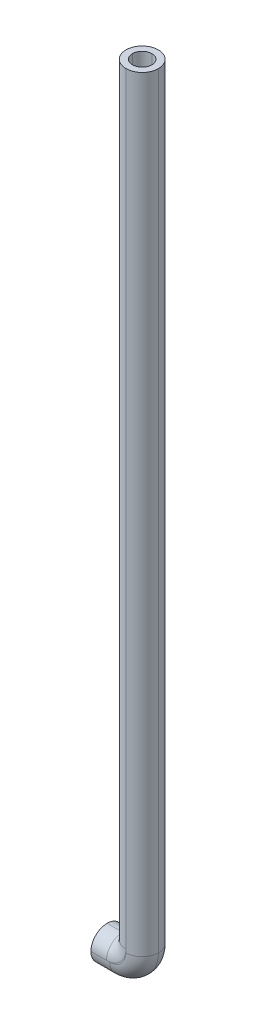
ISO-10303-21;
HEADER;
FILE_DESCRIPTION(('STEP AP214'),'2;1');
FILE_NAME('part.step','',(''),(''),'','','');
FILE_SCHEMA(('AUTOMOTIVE_DESIGN { 1 0 10303 214 1 1 1 1 }'));
ENDSEC;
DATA;
#1=APPLICATION_CONTEXT('core data for automotive mechanical design processes');
#2=APPLICATION_PROTOCOL_DEFINITION('international standard','automotive_design',2000,#1);
#3=PRODUCT_CONTEXT('',#1,'mechanical');
#4=PRODUCT('Part','Part','',(#3));
#5=PRODUCT_RELATED_PRODUCT_CATEGORY('part','',(#4));
#6=PRODUCT_DEFINITION_FORMATION('','',#4);
#7=PRODUCT_DEFINITION_CONTEXT('part definition',#1,'design');
#8=PRODUCT_DEFINITION('design','',#6,#7);
#9=PRODUCT_DEFINITION_SHAPE('','',#8);
#10=(LENGTH_UNIT() NAMED_UNIT(*) SI_UNIT(.MILLI.,.METRE.));
#11=(NAMED_UNIT(*) PLANE_ANGLE_UNIT() SI_UNIT($,.RADIAN.));
#12=(NAMED_UNIT(*) SI_UNIT($,.STERADIAN.) SOLID_ANGLE_UNIT());
#13=UNCERTAINTY_MEASURE_WITH_UNIT(LENGTH_MEASURE(1.E-05),#10,'distance_accuracy_value','');
#14=(GEOMETRIC_REPRESENTATION_CONTEXT(3) GLOBAL_UNCERTAINTY_ASSIGNED_CONTEXT((#13)) GLOBAL_UNIT_ASSIGNED_CONTEXT((#10,
#11,#12)) REPRESENTATION_CONTEXT('',''));
#15=CARTESIAN_POINT('',(0.,0.,0.));
#16=DIRECTION('',(0.,0.,1.));
#17=DIRECTION('',(1.,0.,0.));
#18=AXIS2_PLACEMENT_3D('',#15,#16,#17);
#19=CARTESIAN_POINT('',(-310.599028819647,-49.728751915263,25.4));
#20=DIRECTION('',(0.,-1.,0.));
#21=DIRECTION('',(1.,0.,0.));
#22=AXIS2_PLACEMENT_3D('',#19,#20,#21);
#23=PLANE('',#22);
#24=CARTESIAN_POINT('',(-323.299028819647,-49.728751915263,12.7));
#25=DIRECTION('',(0.,-1.,0.));
#26=DIRECTION('',(1.,0.,0.));
#27=AXIS2_PLACEMENT_3D('',#24,#25,#26);
#28=CIRCLE('',#27,7.62);
#29=CARTESIAN_POINT('',(-323.299028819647,-49.7287519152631,20.32));
#30=VERTEX_POINT('',#29);
#31=CARTESIAN_POINT('',(-330.919028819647,-49.7287519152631,12.7));
#32=VERTEX_POINT('',#31);
#33=EDGE_CURVE('E629',#30,#32,#28,.T.);
#34=ORIENTED_EDGE('',*,*,#33,.T.);
#35=CARTESIAN_POINT('',(-323.299028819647,-49.728751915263,12.7));
#36=DIRECTION('',(0.,-1.,0.));
#37=DIRECTION('',(1.,0.,0.));
#38=AXIS2_PLACEMENT_3D('',#35,#36,#37);
#39=CIRCLE('',#38,7.62);
#40=CARTESIAN_POINT('',(-323.299028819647,-49.7287519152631,5.08));
#41=VERTEX_POINT('',#40);
#42=EDGE_CURVE('E229',#32,#41,#39,.T.);
#43=ORIENTED_EDGE('',*,*,#42,.T.);
#44=CARTESIAN_POINT('',(-323.299028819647,-49.728751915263,12.7));
#45=DIRECTION('',(0.,-1.,0.));
#46=DIRECTION('',(1.,0.,0.));
#47=AXIS2_PLACEMENT_3D('',#44,#45,#46);
#48=CIRCLE('',#47,7.62);
#49=CARTESIAN_POINT('',(-315.679028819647,-49.728751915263,12.7));
#50=VERTEX_POINT('',#49);
#51=EDGE_CURVE('E631',#41,#50,#48,.T.);
#52=ORIENTED_EDGE('',*,*,#51,.T.);
#53=CARTESIAN_POINT('',(-323.299028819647,-49.728751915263,12.7));
#54=DIRECTION('',(0.,-1.,0.));
#55=DIRECTION('',(1.,0.,0.));
#56=AXIS2_PLACEMENT_3D('',#53,#54,#55);
#57=CIRCLE('',#56,7.62);
#58=EDGE_CURVE('E626',#50,#30,#57,.T.);
#59=ORIENTED_EDGE('',*,*,#58,.T.);
#60=EDGE_LOOP('',(#34,#43,#52,#59));
#61=FACE_BOUND('',#60,.T.);
#62=CARTESIAN_POINT('',(-323.299028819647,-49.728751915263,12.7));
#63=DIRECTION('',(0.,-1.,0.));
#64=DIRECTION('',(1.,0.,0.));
#65=AXIS2_PLACEMENT_3D('',#62,#63,#64);
#66=CIRCLE('',#65,12.7);
#67=CARTESIAN_POINT('',(-310.599028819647,-49.728751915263,12.7));
#68=VERTEX_POINT('',#67);
#69=CARTESIAN_POINT('',(-323.299028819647,-49.728751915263,0.));
#70=VERTEX_POINT('',#69);
#71=EDGE_CURVE('E175',#68,#70,#66,.F.);
#72=ORIENTED_EDGE('',*,*,#71,.T.);
#73=CARTESIAN_POINT('',(-323.299028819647,-49.7287519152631,12.7));
#74=DIRECTION('',(0.,-1.,0.));
#75=DIRECTION('',(1.,0.,0.));
#76=AXIS2_PLACEMENT_3D('',#73,#74,#75);
#77=CIRCLE('',#76,12.7);
#78=CARTESIAN_POINT('',(-335.999028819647,-49.7287519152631,12.7));
#79=VERTEX_POINT('',#78);
#80=EDGE_CURVE('E11',#70,#79,#77,.F.);
#81=ORIENTED_EDGE('',*,*,#80,.T.);
#82=CARTESIAN_POINT('',(-323.299028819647,-49.728751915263,12.7));
#83=DIRECTION('',(0.,-1.,0.));
#84=DIRECTION('',(1.,0.,0.));
#85=AXIS2_PLACEMENT_3D('',#82,#83,#84);
#86=CIRCLE('',#85,12.7);
#87=CARTESIAN_POINT('',(-323.299028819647,-49.728751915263,25.4));
#88=VERTEX_POINT('',#87);
#89=EDGE_CURVE('E42',#79,#88,#86,.F.);
#90=ORIENTED_EDGE('',*,*,#89,.T.);
#91=CARTESIAN_POINT('',(-323.299028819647,-49.728751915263,12.7));
#92=DIRECTION('',(0.,-1.,0.));
#93=DIRECTION('',(1.,0.,0.));
#94=AXIS2_PLACEMENT_3D('',#91,#92,#93);
#95=CIRCLE('',#94,12.7);
#96=EDGE_CURVE('E51',#88,#68,#95,.F.);
#97=ORIENTED_EDGE('',*,*,#96,.T.);
#98=EDGE_LOOP('',(#72,#81,#90,#97));
#99=FACE_BOUND('',#98,.T.);
#100=ADVANCED_FACE('F32',(#61,#99),#23,.F.);
#101=CARTESIAN_POINT('',(-350.731028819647,-649.228751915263,25.4));
#102=DIRECTION('',(1.,0.,0.));
#103=DIRECTION('',(0.,0.,-1.));
#104=AXIS2_PLACEMENT_3D('',#101,#102,#103);
#105=PLANE('',#104);
#106=CARTESIAN_POINT('',(-350.731028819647,-661.928751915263,12.7));
#107=DIRECTION('',(1.,0.,0.));
#108=DIRECTION('',(0.,0.,-1.));
#109=AXIS2_PLACEMENT_3D('',#106,#107,#108);
#110=CIRCLE('',#109,7.62);
#111=CARTESIAN_POINT('',(-350.731028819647,-669.548751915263,12.7));
#112=VERTEX_POINT('',#111);
#113=CARTESIAN_POINT('',(-350.731028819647,-661.928751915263,5.08));
#114=VERTEX_POINT('',#113);
#115=EDGE_CURVE('E623',#112,#114,#110,.T.);
#116=ORIENTED_EDGE('',*,*,#115,.T.);
#117=CARTESIAN_POINT('',(-350.731028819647,-661.928751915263,12.7));
#118=DIRECTION('',(1.,0.,0.));
#119=DIRECTION('',(0.,0.,-1.));
#120=AXIS2_PLACEMENT_3D('',#117,#118,#119);
#121=CIRCLE('',#120,7.62);
#122=CARTESIAN_POINT('',(-350.731028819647,-654.308751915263,12.7));
#123=VERTEX_POINT('',#122);
#124=EDGE_CURVE('E611',#114,#123,#121,.T.);
#125=ORIENTED_EDGE('',*,*,#124,.T.);
#126=CARTESIAN_POINT('',(-350.731028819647,-661.928751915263,12.7));
#127=DIRECTION('',(1.,0.,0.));
#128=DIRECTION('',(0.,0.,-1.));
#129=AXIS2_PLACEMENT_3D('',#126,#127,#128);
#130=CIRCLE('',#129,7.62);
#131=CARTESIAN_POINT('',(-350.731028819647,-661.928751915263,20.32));
#132=VERTEX_POINT('',#131);
#133=EDGE_CURVE('E617',#123,#132,#130,.T.);
#134=ORIENTED_EDGE('',*,*,#133,.T.);
#135=CARTESIAN_POINT('',(-350.731028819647,-661.928751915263,12.7));
#136=DIRECTION('',(1.,0.,0.));
#137=DIRECTION('',(0.,0.,-1.));
#138=AXIS2_PLACEMENT_3D('',#135,#136,#137);
#139=CIRCLE('',#138,7.62);
#140=EDGE_CURVE('E614',#132,#112,#139,.T.);
#141=ORIENTED_EDGE('',*,*,#140,.T.);
#142=EDGE_LOOP('',(#116,#125,#134,#141));
#143=FACE_BOUND('',#142,.T.);
#144=CARTESIAN_POINT('',(-350.731028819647,-661.928751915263,12.7));
#145=DIRECTION('',(1.,0.,0.));
#146=DIRECTION('',(0.,0.,-1.));
#147=AXIS2_PLACEMENT_3D('',#144,#145,#146);
#148=CIRCLE('',#147,12.7);
#149=CARTESIAN_POINT('',(-350.731028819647,-661.928751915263,25.4));
#150=VERTEX_POINT('',#149);
#151=CARTESIAN_POINT('',(-350.731028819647,-649.228751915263,12.7));
#152=VERTEX_POINT('',#151);
#153=EDGE_CURVE('E146',#150,#152,#148,.F.);
#154=ORIENTED_EDGE('',*,*,#153,.T.);
#155=CARTESIAN_POINT('',(-350.731028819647,-661.928751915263,12.7));
#156=DIRECTION('',(1.,0.,0.));
#157=DIRECTION('',(0.,0.,-1.));
#158=AXIS2_PLACEMENT_3D('',#155,#156,#157);
#159=CIRCLE('',#158,12.7);
#160=CARTESIAN_POINT('',(-350.731028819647,-661.928751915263,0.));
#161=VERTEX_POINT('',#160);
#162=EDGE_CURVE('E281',#152,#161,#159,.F.);
#163=ORIENTED_EDGE('',*,*,#162,.T.);
#164=CARTESIAN_POINT('',(-350.731028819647,-661.928751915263,12.7));
#165=DIRECTION('',(1.,0.,0.));
#166=DIRECTION('',(0.,0.,-1.));
#167=AXIS2_PLACEMENT_3D('',#164,#165,#166);
#168=CIRCLE('',#167,12.7);
#169=CARTESIAN_POINT('',(-350.731028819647,-674.628751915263,12.7));
#170=VERTEX_POINT('',#169);
#171=EDGE_CURVE('E278',#161,#170,#168,.F.);
#172=ORIENTED_EDGE('',*,*,#171,.T.);
#173=CARTESIAN_POINT('',(-350.731028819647,-661.928751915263,12.7));
#174=DIRECTION('',(1.,0.,0.));
#175=DIRECTION('',(0.,0.,-1.));
#176=AXIS2_PLACEMENT_3D('',#173,#174,#175);
#177=CIRCLE('',#176,12.7);
#178=EDGE_CURVE('E276',#170,#150,#177,.F.);
#179=ORIENTED_EDGE('',*,*,#178,.T.);
#180=EDGE_LOOP('',(#154,#163,#172,#179));
#181=FACE_BOUND('',#180,.T.);
#182=ADVANCED_FACE('F317',(#143,#181),#105,.F.);
#183=CARTESIAN_POINT('',(-335.999028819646,-649.228751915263,25.4));
#184=DIRECTION('',(0.,0.,1.));
#185=DIRECTION('',(1.,0.,0.));
#186=AXIS2_PLACEMENT_3D('',#183,#184,#185);
#187=PLANE('',#186);
#188=DIRECTION('',(0.,1.,0.));
#189=VECTOR('',#188,1.);
#190=CARTESIAN_POINT('',(-323.299028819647,-49.728751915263,25.4));
#191=LINE('',#190,#189);
#192=CARTESIAN_POINT('',(-323.299028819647,-649.228751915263,25.4));
#193=VERTEX_POINT('',#192);
#194=CARTESIAN_POINT('',(-323.299028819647,-646.688751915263,25.4));
#195=VERTEX_POINT('',#194);
#196=EDGE_CURVE('E172',#193,#195,#191,.T.);
#197=ORIENTED_EDGE('',*,*,#196,.T.);
#198=CARTESIAN_POINT('',(-338.539028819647,-646.688751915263,25.4));
#199=DIRECTION('',(0.,0.,1.));
#200=DIRECTION('',(1.,0.,0.));
#201=AXIS2_PLACEMENT_3D('',#198,#199,#200);
#202=CIRCLE('',#201,15.24);
#203=CARTESIAN_POINT('',(-338.539028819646,-661.928751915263,25.4));
#204=VERTEX_POINT('',#203);
#205=EDGE_CURVE('E157',#195,#204,#202,.F.);
#206=ORIENTED_EDGE('',*,*,#205,.T.);
#207=DIRECTION('',(1.,0.,0.));
#208=VECTOR('',#207,1.);
#209=CARTESIAN_POINT('',(-335.999028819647,-661.928751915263,25.4));
#210=LINE('',#209,#208);
#211=CARTESIAN_POINT('',(-335.999028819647,-661.928751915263,25.4));
#212=VERTEX_POINT('',#211);
#213=EDGE_CURVE('E162',#204,#212,#210,.T.);
#214=ORIENTED_EDGE('',*,*,#213,.T.);
#215=CARTESIAN_POINT('',(-335.999028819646,-649.228751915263,25.4));
#216=DIRECTION('',(0.,0.,1.));
#217=DIRECTION('',(1.,0.,0.));
#218=AXIS2_PLACEMENT_3D('',#215,#216,#217);
#219=CIRCLE('',#218,12.7);
#220=EDGE_CURVE('E168',#212,#193,#219,.T.);
#221=ORIENTED_EDGE('',*,*,#220,.T.);
#222=EDGE_LOOP('',(#197,#206,#214,#221));
#223=FACE_BOUND('',#222,.T.);
#224=ADVANCED_FACE('F170',(#223),#187,.T.);
#225=CARTESIAN_POINT('',(-335.999028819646,-649.228751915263,0.));
#226=DIRECTION('',(0.,0.,1.));
#227=DIRECTION('',(1.,0.,0.));
#228=AXIS2_PLACEMENT_3D('',#225,#226,#227);
#229=PLANE('',#228);
#230=DIRECTION('',(1.,0.,0.));
#231=VECTOR('',#230,1.);
#232=CARTESIAN_POINT('',(-335.999028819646,-661.928751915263,0.));
#233=LINE('',#232,#231);
#234=CARTESIAN_POINT('',(-335.999028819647,-661.928751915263,0.));
#235=VERTEX_POINT('',#234);
#236=CARTESIAN_POINT('',(-338.539028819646,-661.928751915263,0.));
#237=VERTEX_POINT('',#236);
#238=EDGE_CURVE('E288',#235,#237,#233,.F.);
#239=ORIENTED_EDGE('',*,*,#238,.T.);
#240=CARTESIAN_POINT('',(-338.539028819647,-646.688751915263,0.));
#241=DIRECTION('',(0.,0.,1.));
#242=DIRECTION('',(1.,0.,0.));
#243=AXIS2_PLACEMENT_3D('',#240,#241,#242);
#244=CIRCLE('',#243,15.24);
#245=CARTESIAN_POINT('',(-323.299028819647,-646.688751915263,0.));
#246=VERTEX_POINT('',#245);
#247=EDGE_CURVE('E290',#237,#246,#244,.T.);
#248=ORIENTED_EDGE('',*,*,#247,.T.);
#249=DIRECTION('',(0.,1.,0.));
#250=VECTOR('',#249,1.);
#251=CARTESIAN_POINT('',(-323.299028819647,-649.228751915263,0.));
#252=LINE('',#251,#250);
#253=CARTESIAN_POINT('',(-323.299028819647,-649.228751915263,0.));
#254=VERTEX_POINT('',#253);
#255=EDGE_CURVE('E284',#246,#254,#252,.F.);
#256=ORIENTED_EDGE('',*,*,#255,.T.);
#257=CARTESIAN_POINT('',(-335.999028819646,-649.228751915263,0.));
#258=DIRECTION('',(0.,0.,1.));
#259=DIRECTION('',(1.,0.,0.));
#260=AXIS2_PLACEMENT_3D('',#257,#258,#259);
#261=CIRCLE('',#260,12.7);
#262=EDGE_CURVE('E286',#254,#235,#261,.F.);
#263=ORIENTED_EDGE('',*,*,#262,.T.);
#264=EDGE_LOOP('',(#239,#248,#256,#263));
#265=FACE_BOUND('',#264,.T.);
#266=ADVANCED_FACE('F304',(#265),#229,.F.);
#267=CARTESIAN_POINT('',(0.,0.,5.08));
#268=DIRECTION('',(0.,0.,1.));
#269=DIRECTION('',(1.,0.,0.));
#270=AXIS2_PLACEMENT_3D('',#267,#268,#269);
#271=PLANE('',#270);
#272=CARTESIAN_POINT('',(-338.539028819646,-646.688751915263,5.08));
#273=DIRECTION('',(0.,0.,1.));
#274=DIRECTION('',(1.,0.,0.));
#275=AXIS2_PLACEMENT_3D('',#272,#273,#274);
#276=CIRCLE('',#275,15.2399999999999);
#277=CARTESIAN_POINT('',(-323.299028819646,-646.688751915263,5.08));
#278=VERTEX_POINT('',#277);
#279=CARTESIAN_POINT('',(-338.539028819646,-661.928751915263,5.08));
#280=VERTEX_POINT('',#279);
#281=EDGE_CURVE('E593',#278,#280,#276,.F.);
#282=ORIENTED_EDGE('',*,*,#281,.T.);
#283=DIRECTION('',(-1.,0.,0.));
#284=VECTOR('',#283,1.);
#285=CARTESIAN_POINT('',(-335.999028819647,-661.928751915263,5.08));
#286=LINE('',#285,#284);
#287=CARTESIAN_POINT('',(-335.999028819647,-661.928751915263,5.08));
#288=VERTEX_POINT('',#287);
#289=EDGE_CURVE('E598',#280,#288,#286,.F.);
#290=ORIENTED_EDGE('',*,*,#289,.T.);
#291=CARTESIAN_POINT('',(-335.999028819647,-649.228751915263,5.08));
#292=DIRECTION('',(0.,0.,1.));
#293=DIRECTION('',(1.,0.,0.));
#294=AXIS2_PLACEMENT_3D('',#291,#292,#293);
#295=CIRCLE('',#294,12.7000000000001);
#296=CARTESIAN_POINT('',(-323.299028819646,-649.228751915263,5.08));
#297=VERTEX_POINT('',#296);
#298=EDGE_CURVE('E603',#288,#297,#295,.T.);
#299=ORIENTED_EDGE('',*,*,#298,.T.);
#300=DIRECTION('',(0.,-1.,0.));
#301=VECTOR('',#300,1.);
#302=CARTESIAN_POINT('',(-323.299028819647,-49.728751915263,5.08));
#303=LINE('',#302,#301);
#304=EDGE_CURVE('E601',#297,#278,#303,.F.);
#305=ORIENTED_EDGE('',*,*,#304,.T.);
#306=EDGE_LOOP('',(#282,#290,#299,#305));
#307=FACE_BOUND('',#306,.T.);
#308=ADVANCED_FACE('F462',(#307),#271,.T.);
#309=CARTESIAN_POINT('',(0.,0.,20.32));
#310=DIRECTION('',(0.,0.,1.));
#311=DIRECTION('',(1.,0.,0.));
#312=AXIS2_PLACEMENT_3D('',#309,#310,#311);
#313=PLANE('',#312);
#314=CARTESIAN_POINT('',(-335.999028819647,-649.228751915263,20.32));
#315=DIRECTION('',(0.,0.,1.));
#316=DIRECTION('',(1.,0.,0.));
#317=AXIS2_PLACEMENT_3D('',#314,#315,#316);
#318=CIRCLE('',#317,12.7000000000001);
#319=CARTESIAN_POINT('',(-323.299028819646,-649.228751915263,20.32));
#320=VERTEX_POINT('',#319);
#321=CARTESIAN_POINT('',(-335.999028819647,-661.928751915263,20.32));
#322=VERTEX_POINT('',#321);
#323=EDGE_CURVE('E673',#320,#322,#318,.F.);
#324=ORIENTED_EDGE('',*,*,#323,.T.);
#325=DIRECTION('',(-1.,0.,0.));
#326=VECTOR('',#325,1.);
#327=CARTESIAN_POINT('',(0.,-661.928751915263,20.32));
#328=LINE('',#327,#326);
#329=CARTESIAN_POINT('',(-338.539028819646,-661.928751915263,20.32));
#330=VERTEX_POINT('',#329);
#331=EDGE_CURVE('E672',#322,#330,#328,.T.);
#332=ORIENTED_EDGE('',*,*,#331,.T.);
#333=CARTESIAN_POINT('',(-338.539028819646,-646.688751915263,20.32));
#334=DIRECTION('',(0.,0.,1.));
#335=DIRECTION('',(1.,0.,0.));
#336=AXIS2_PLACEMENT_3D('',#333,#334,#335);
#337=CIRCLE('',#336,15.2399999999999);
#338=CARTESIAN_POINT('',(-323.299028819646,-646.688751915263,20.32));
#339=VERTEX_POINT('',#338);
#340=EDGE_CURVE('E671',#330,#339,#337,.T.);
#341=ORIENTED_EDGE('',*,*,#340,.T.);
#342=DIRECTION('',(0.,-1.,0.));
#343=VECTOR('',#342,1.);
#344=CARTESIAN_POINT('',(-323.299028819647,0.,20.32));
#345=LINE('',#344,#343);
#346=EDGE_CURVE('E275',#339,#320,#345,.T.);
#347=ORIENTED_EDGE('',*,*,#346,.T.);
#348=EDGE_LOOP('',(#324,#332,#341,#347));
#349=FACE_BOUND('',#348,.T.);
#350=ADVANCED_FACE('F376',(#349),#313,.F.);
#351=CARTESIAN_POINT('',(-323.299028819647,0.,12.7));
#352=DIRECTION('',(0.,-1.,0.));
#353=DIRECTION('',(0.,0.,-1.));
#354=AXIS2_PLACEMENT_3D('',#351,#352,#353);
#355=CYLINDRICAL_SURFACE('',#354,7.62);
#356=CARTESIAN_POINT('',(-323.299028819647,-646.688751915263,12.7));
#357=DIRECTION('',(0.,1.,0.));
#358=DIRECTION('',(0.,0.,1.));
#359=AXIS2_PLACEMENT_3D('',#356,#357,#358);
#360=CIRCLE('',#359,7.62);
#361=CARTESIAN_POINT('',(-330.919028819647,-646.688751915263,12.7));
#362=VERTEX_POINT('',#361);
#363=EDGE_CURVE('E266',#278,#362,#360,.T.);
#364=ORIENTED_EDGE('',*,*,#363,.F.);
#365=DIRECTION('',(0.,1.,0.));
#366=VECTOR('',#365,1.);
#367=CARTESIAN_POINT('',(-323.299028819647,-646.688751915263,5.08));
#368=LINE('',#367,#366);
#369=EDGE_CURVE('E272',#41,#278,#368,.F.);
#370=ORIENTED_EDGE('',*,*,#369,.F.);
#371=ORIENTED_EDGE('',*,*,#42,.F.);
#372=DIRECTION('',(0.,1.,0.));
#373=VECTOR('',#372,1.);
#374=CARTESIAN_POINT('',(-330.919028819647,-49.7287519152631,12.7));
#375=LINE('',#374,#373);
#376=EDGE_CURVE('E269',#362,#32,#375,.T.);
#377=ORIENTED_EDGE('',*,*,#376,.F.);
#378=EDGE_LOOP('',(#364,#370,#371,#377));
#379=FACE_BOUND('',#378,.T.);
#380=ADVANCED_FACE('F372',(#379),#355,.F.);
#381=CARTESIAN_POINT('',(-323.299028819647,0.,12.7));
#382=DIRECTION('',(0.,1.,0.));
#383=DIRECTION('',(-1.,0.,0.));
#384=AXIS2_PLACEMENT_3D('',#381,#382,#383);
#385=CYLINDRICAL_SURFACE('',#384,7.62);
#386=ORIENTED_EDGE('',*,*,#369,.T.);
#387=ORIENTED_EDGE('',*,*,#304,.F.);
#388=CARTESIAN_POINT('',(-323.299028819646,-649.228751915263,12.7));
#389=DIRECTION('',(0.,1.,0.));
#390=DIRECTION('',(0.,0.,1.));
#391=AXIS2_PLACEMENT_3D('',#388,#389,#390);
#392=CIRCLE('',#391,7.62);
#393=CARTESIAN_POINT('',(-315.679028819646,-649.228751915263,12.7));
#394=VERTEX_POINT('',#393);
#395=EDGE_CURVE('E263',#394,#297,#392,.T.);
#396=ORIENTED_EDGE('',*,*,#395,.F.);
#397=DIRECTION('',(0.,-1.,0.));
#398=VECTOR('',#397,1.);
#399=CARTESIAN_POINT('',(-315.679028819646,-649.228751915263,12.7));
#400=LINE('',#399,#398);
#401=EDGE_CURVE('E260',#50,#394,#400,.T.);
#402=ORIENTED_EDGE('',*,*,#401,.F.);
#403=ORIENTED_EDGE('',*,*,#51,.F.);
#404=EDGE_LOOP('',(#386,#387,#396,#402,#403));
#405=FACE_BOUND('',#404,.T.);
#406=ADVANCED_FACE('F368',(#405),#385,.F.);
#407=CARTESIAN_POINT('',(-323.299028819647,0.,12.7));
#408=DIRECTION('',(0.,1.,0.));
#409=DIRECTION('',(0.,0.,1.));
#410=AXIS2_PLACEMENT_3D('',#407,#408,#409);
#411=CYLINDRICAL_SURFACE('',#410,7.62);
#412=ORIENTED_EDGE('',*,*,#376,.T.);
#413=ORIENTED_EDGE('',*,*,#33,.F.);
#414=DIRECTION('',(0.,1.,0.));
#415=VECTOR('',#414,1.);
#416=CARTESIAN_POINT('',(-323.299028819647,0.,20.32));
#417=LINE('',#416,#415);
#418=EDGE_CURVE('E257',#339,#30,#417,.T.);
#419=ORIENTED_EDGE('',*,*,#418,.F.);
#420=CARTESIAN_POINT('',(-323.299028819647,-646.688751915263,12.7));
#421=DIRECTION('',(0.,1.,0.));
#422=DIRECTION('',(0.,0.,1.));
#423=AXIS2_PLACEMENT_3D('',#420,#421,#422);
#424=CIRCLE('',#423,7.62);
#425=EDGE_CURVE('E254',#362,#339,#424,.T.);
#426=ORIENTED_EDGE('',*,*,#425,.F.);
#427=EDGE_LOOP('',(#412,#413,#419,#426));
#428=FACE_BOUND('',#427,.T.);
#429=ADVANCED_FACE('F364',(#428),#411,.F.);
#430=CARTESIAN_POINT('',(-338.539028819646,-646.688751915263,12.7));
#431=DIRECTION('',(0.,0.,1.));
#432=DIRECTION('',(1.,0.,0.));
#433=AXIS2_PLACEMENT_3D('',#430,#431,#432);
#434=TOROIDAL_SURFACE('',#433,15.2399999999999,7.62);
#435=ORIENTED_EDGE('',*,*,#281,.F.);
#436=ORIENTED_EDGE('',*,*,#363,.T.);
#437=CARTESIAN_POINT('',(-338.539028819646,-646.688751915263,12.7));
#438=DIRECTION('',(0.,0.,1.));
#439=DIRECTION('',(1.,0.,0.));
#440=AXIS2_PLACEMENT_3D('',#437,#438,#439);
#441=CIRCLE('',#440,7.61999999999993);
#442=CARTESIAN_POINT('',(-338.539028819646,-654.308751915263,12.7));
#443=VERTEX_POINT('',#442);
#444=EDGE_CURVE('E251',#443,#362,#441,.T.);
#445=ORIENTED_EDGE('',*,*,#444,.F.);
#446=CARTESIAN_POINT('',(-338.539028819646,-661.928751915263,12.7));
#447=DIRECTION('',(1.,0.,0.));
#448=DIRECTION('',(0.,1.,0.));
#449=AXIS2_PLACEMENT_3D('',#446,#447,#448);
#450=CIRCLE('',#449,7.62);
#451=EDGE_CURVE('E248',#280,#443,#450,.T.);
#452=ORIENTED_EDGE('',*,*,#451,.F.);
#453=EDGE_LOOP('',(#435,#436,#445,#452));
#454=FACE_BOUND('',#453,.T.);
#455=ADVANCED_FACE('F361',(#454),#434,.F.);
#456=CARTESIAN_POINT('',(-335.999028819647,-649.228751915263,12.7));
#457=DIRECTION('',(0.,0.,1.));
#458=DIRECTION('',(1.,0.,0.));
#459=AXIS2_PLACEMENT_3D('',#456,#457,#458);
#460=TOROIDAL_SURFACE('',#459,12.7000000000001,7.62);
#461=ORIENTED_EDGE('',*,*,#395,.T.);
#462=ORIENTED_EDGE('',*,*,#298,.F.);
#463=CARTESIAN_POINT('',(-335.999028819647,-661.928751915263,12.7));
#464=DIRECTION('',(1.,0.,0.));
#465=DIRECTION('',(0.,0.,-1.));
#466=AXIS2_PLACEMENT_3D('',#463,#464,#465);
#467=CIRCLE('',#466,7.62);
#468=CARTESIAN_POINT('',(-335.999028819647,-669.548751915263,12.7));
#469=VERTEX_POINT('',#468);
#470=EDGE_CURVE('E84',#469,#288,#467,.T.);
#471=ORIENTED_EDGE('',*,*,#470,.F.);
#472=CARTESIAN_POINT('',(-335.999028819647,-649.228751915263,12.7));
#473=DIRECTION('',(0.,0.,1.));
#474=DIRECTION('',(1.,0.,0.));
#475=AXIS2_PLACEMENT_3D('',#472,#473,#474);
#476=CIRCLE('',#475,20.3200000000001);
#477=EDGE_CURVE('E242',#394,#469,#476,.F.);
#478=ORIENTED_EDGE('',*,*,#477,.F.);
#479=EDGE_LOOP('',(#461,#462,#471,#478));
#480=FACE_BOUND('',#479,.T.);
#481=ADVANCED_FACE('F357',(#480),#460,.F.);
#482=CARTESIAN_POINT('',(-323.299028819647,0.,12.7));
#483=DIRECTION('',(0.,-1.,0.));
#484=DIRECTION('',(1.,0.,0.));
#485=AXIS2_PLACEMENT_3D('',#482,#483,#484);
#486=CYLINDRICAL_SURFACE('',#485,7.62);
#487=ORIENTED_EDGE('',*,*,#58,.F.);
#488=ORIENTED_EDGE('',*,*,#401,.T.);
#489=CARTESIAN_POINT('',(-323.299028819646,-649.228751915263,12.7));
#490=DIRECTION('',(0.,1.,0.));
#491=DIRECTION('',(0.,0.,1.));
#492=AXIS2_PLACEMENT_3D('',#489,#490,#491);
#493=CIRCLE('',#492,7.62);
#494=EDGE_CURVE('E239',#320,#394,#493,.T.);
#495=ORIENTED_EDGE('',*,*,#494,.F.);
#496=ORIENTED_EDGE('',*,*,#346,.F.);
#497=ORIENTED_EDGE('',*,*,#418,.T.);
#498=EDGE_LOOP('',(#487,#488,#495,#496,#497));
#499=FACE_BOUND('',#498,.T.);
#500=ADVANCED_FACE('F353',(#499),#486,.F.);
#501=CARTESIAN_POINT('',(-338.539028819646,-646.688751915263,12.7));
#502=DIRECTION('',(0.,0.,1.));
#503=DIRECTION('',(1.,0.,0.));
#504=AXIS2_PLACEMENT_3D('',#501,#502,#503);
#505=TOROIDAL_SURFACE('',#504,15.2399999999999,7.62);
#506=ORIENTED_EDGE('',*,*,#425,.T.);
#507=ORIENTED_EDGE('',*,*,#340,.F.);
#508=CARTESIAN_POINT('',(-338.539028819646,-661.928751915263,12.7));
#509=DIRECTION('',(1.,0.,0.));
#510=DIRECTION('',(0.,0.,-1.));
#511=AXIS2_PLACEMENT_3D('',#508,#509,#510);
#512=CIRCLE('',#511,7.62);
#513=EDGE_CURVE('E237',#443,#330,#512,.T.);
#514=ORIENTED_EDGE('',*,*,#513,.F.);
#515=ORIENTED_EDGE('',*,*,#444,.T.);
#516=EDGE_LOOP('',(#506,#507,#514,#515));
#517=FACE_BOUND('',#516,.T.);
#518=ADVANCED_FACE('F349',(#517),#505,.F.);
#519=CARTESIAN_POINT('',(6.02762910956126E-12,-661.92875191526,12.7));
#520=DIRECTION('',(-1.,0.,0.));
#521=DIRECTION('',(0.,-1.,0.));
#522=AXIS2_PLACEMENT_3D('',#519,#520,#521);
#523=CYLINDRICAL_SURFACE('',#522,7.62);
#524=DIRECTION('',(1.,0.,0.));
#525=VECTOR('',#524,1.);
#526=CARTESIAN_POINT('',(-338.539028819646,-654.308751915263,12.7));
#527=LINE('',#526,#525);
#528=EDGE_CURVE('E234',#123,#443,#527,.T.);
#529=ORIENTED_EDGE('',*,*,#528,.F.);
#530=ORIENTED_EDGE('',*,*,#124,.F.);
#531=DIRECTION('',(1.,0.,0.));
#532=VECTOR('',#531,1.);
#533=CARTESIAN_POINT('',(-350.731028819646,-661.928751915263,5.08));
#534=LINE('',#533,#532);
#535=EDGE_CURVE('E245',#280,#114,#534,.F.);
#536=ORIENTED_EDGE('',*,*,#535,.F.);
#537=ORIENTED_EDGE('',*,*,#451,.T.);
#538=EDGE_LOOP('',(#529,#530,#536,#537));
#539=FACE_BOUND('',#538,.T.);
#540=ADVANCED_FACE('F345',(#539),#523,.F.);
#541=CARTESIAN_POINT('',(0.,-661.928751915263,12.7));
#542=DIRECTION('',(1.,0.,0.));
#543=DIRECTION('',(0.,0.,-1.));
#544=AXIS2_PLACEMENT_3D('',#541,#542,#543);
#545=CYLINDRICAL_SURFACE('',#544,7.62);
#546=ORIENTED_EDGE('',*,*,#535,.T.);
#547=ORIENTED_EDGE('',*,*,#115,.F.);
#548=DIRECTION('',(-1.,0.,0.));
#549=VECTOR('',#548,1.);
#550=CARTESIAN_POINT('',(-350.731028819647,-669.548751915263,12.7));
#551=LINE('',#550,#549);
#552=EDGE_CURVE('E226',#469,#112,#551,.T.);
#553=ORIENTED_EDGE('',*,*,#552,.F.);
#554=ORIENTED_EDGE('',*,*,#470,.T.);
#555=ORIENTED_EDGE('',*,*,#289,.F.);
#556=EDGE_LOOP('',(#546,#547,#553,#554,#555));
#557=FACE_BOUND('',#556,.T.);
#558=ADVANCED_FACE('F341',(#557),#545,.F.);
#559=CARTESIAN_POINT('',(-335.999028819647,-649.228751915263,12.7));
#560=DIRECTION('',(0.,0.,1.));
#561=DIRECTION('',(1.,0.,0.));
#562=AXIS2_PLACEMENT_3D('',#559,#560,#561);
#563=TOROIDAL_SURFACE('',#562,12.7000000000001,7.62);
#564=ORIENTED_EDGE('',*,*,#494,.T.);
#565=ORIENTED_EDGE('',*,*,#477,.T.);
#566=CARTESIAN_POINT('',(-335.999028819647,-661.928751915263,12.7));
#567=DIRECTION('',(1.,0.,0.));
#568=DIRECTION('',(0.,0.,-1.));
#569=AXIS2_PLACEMENT_3D('',#566,#567,#568);
#570=CIRCLE('',#569,7.62);
#571=EDGE_CURVE('E217',#322,#469,#570,.T.);
#572=ORIENTED_EDGE('',*,*,#571,.F.);
#573=ORIENTED_EDGE('',*,*,#323,.F.);
#574=EDGE_LOOP('',(#564,#565,#572,#573));
#575=FACE_BOUND('',#574,.T.);
#576=ADVANCED_FACE('F337',(#575),#563,.F.);
#577=CARTESIAN_POINT('',(6.02762910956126E-12,-661.92875191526,12.7));
#578=DIRECTION('',(1.,0.,0.));
#579=DIRECTION('',(0.,1.,0.));
#580=AXIS2_PLACEMENT_3D('',#577,#578,#579);
#581=CYLINDRICAL_SURFACE('',#580,7.62);
#582=ORIENTED_EDGE('',*,*,#528,.T.);
#583=ORIENTED_EDGE('',*,*,#513,.T.);
#584=DIRECTION('',(1.,0.,0.));
#585=VECTOR('',#584,1.);
#586=CARTESIAN_POINT('',(6.02762910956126E-12,-661.92875191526,20.32));
#587=LINE('',#586,#585);
#588=EDGE_CURVE('E215',#132,#330,#587,.T.);
#589=ORIENTED_EDGE('',*,*,#588,.F.);
#590=ORIENTED_EDGE('',*,*,#133,.F.);
#591=EDGE_LOOP('',(#582,#583,#589,#590));
#592=FACE_BOUND('',#591,.T.);
#593=ADVANCED_FACE('F334',(#592),#581,.F.);
#594=CARTESIAN_POINT('',(0.,-661.928751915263,12.7));
#595=DIRECTION('',(-1.,0.,0.));
#596=DIRECTION('',(0.,0.,1.));
#597=AXIS2_PLACEMENT_3D('',#594,#595,#596);
#598=CYLINDRICAL_SURFACE('',#597,7.62);
#599=ORIENTED_EDGE('',*,*,#571,.T.);
#600=ORIENTED_EDGE('',*,*,#552,.T.);
#601=ORIENTED_EDGE('',*,*,#140,.F.);
#602=ORIENTED_EDGE('',*,*,#588,.T.);
#603=ORIENTED_EDGE('',*,*,#331,.F.);
#604=EDGE_LOOP('',(#599,#600,#601,#602,#603));
#605=FACE_BOUND('',#604,.T.);
#606=ADVANCED_FACE('F331',(#605),#598,.F.);
#607=CARTESIAN_POINT('',(-323.299028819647,-649.228751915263,12.7));
#608=DIRECTION('',(0.,-1.,0.));
#609=DIRECTION('',(1.,0.,0.));
#610=AXIS2_PLACEMENT_3D('',#607,#608,#609);
#611=CYLINDRICAL_SURFACE('',#610,12.7);
#612=DIRECTION('',(0.,1.,0.));
#613=VECTOR('',#612,1.);
#614=CARTESIAN_POINT('',(-310.599028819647,-649.228751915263,12.7));
#615=LINE('',#614,#613);
#616=CARTESIAN_POINT('',(-310.599028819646,-649.228751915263,12.7));
#617=VERTEX_POINT('',#616);
#618=EDGE_CURVE('E36',#68,#617,#615,.F.);
#619=ORIENTED_EDGE('',*,*,#618,.F.);
#620=ORIENTED_EDGE('',*,*,#96,.F.);
#621=DIRECTION('',(0.,1.,0.));
#622=VECTOR('',#621,1.);
#623=CARTESIAN_POINT('',(-323.299028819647,-49.728751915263,25.4));
#624=LINE('',#623,#622);
#625=EDGE_CURVE('E210',#195,#88,#624,.T.);
#626=ORIENTED_EDGE('',*,*,#625,.F.);
#627=ORIENTED_EDGE('',*,*,#196,.F.);
#628=CARTESIAN_POINT('',(-323.299028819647,-649.228751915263,12.7));
#629=DIRECTION('',(0.,-1.,0.));
#630=DIRECTION('',(0.,0.,-1.));
#631=AXIS2_PLACEMENT_3D('',#628,#629,#630);
#632=CIRCLE('',#631,12.7);
#633=EDGE_CURVE('E208',#617,#193,#632,.T.);
#634=ORIENTED_EDGE('',*,*,#633,.F.);
#635=EDGE_LOOP('',(#619,#620,#626,#627,#634));
#636=FACE_BOUND('',#635,.T.);
#637=ADVANCED_FACE('F34',(#636),#611,.T.);
#638=CARTESIAN_POINT('',(-323.299028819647,-49.728751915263,12.7));
#639=DIRECTION('',(0.,1.,0.));
#640=DIRECTION('',(-1.,0.,0.));
#641=AXIS2_PLACEMENT_3D('',#638,#639,#640);
#642=CYLINDRICAL_SURFACE('',#641,12.7);
#643=ORIENTED_EDGE('',*,*,#71,.F.);
#644=ORIENTED_EDGE('',*,*,#618,.T.);
#645=CARTESIAN_POINT('',(-323.299028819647,-649.228751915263,12.7));
#646=DIRECTION('',(0.,-1.,0.));
#647=DIRECTION('',(1.,0.,0.));
#648=AXIS2_PLACEMENT_3D('',#645,#646,#647);
#649=CIRCLE('',#648,12.7);
#650=EDGE_CURVE('E205',#254,#617,#649,.T.);
#651=ORIENTED_EDGE('',*,*,#650,.F.);
#652=ORIENTED_EDGE('',*,*,#255,.F.);
#653=DIRECTION('',(0.,1.,0.));
#654=VECTOR('',#653,1.);
#655=CARTESIAN_POINT('',(-323.299028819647,-649.228751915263,0.));
#656=LINE('',#655,#654);
#657=EDGE_CURVE('E202',#70,#246,#656,.F.);
#658=ORIENTED_EDGE('',*,*,#657,.F.);
#659=EDGE_LOOP('',(#643,#644,#651,#652,#658));
#660=FACE_BOUND('',#659,.T.);
#661=ADVANCED_FACE('F299',(#660),#642,.T.);
#662=CARTESIAN_POINT('',(-323.299028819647,-649.228751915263,12.7));
#663=DIRECTION('',(0.,1.,0.));
#664=DIRECTION('',(-1.,0.,0.));
#665=AXIS2_PLACEMENT_3D('',#662,#663,#664);
#666=CYLINDRICAL_SURFACE('',#665,12.7);
#667=ORIENTED_EDGE('',*,*,#625,.T.);
#668=ORIENTED_EDGE('',*,*,#89,.F.);
#669=DIRECTION('',(0.,-1.,0.));
#670=VECTOR('',#669,1.);
#671=CARTESIAN_POINT('',(-335.999028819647,-49.7287519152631,12.7));
#672=LINE('',#671,#670);
#673=CARTESIAN_POINT('',(-335.999028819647,-646.688751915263,12.7));
#674=VERTEX_POINT('',#673);
#675=EDGE_CURVE('E200',#674,#79,#672,.F.);
#676=ORIENTED_EDGE('',*,*,#675,.F.);
#677=CARTESIAN_POINT('',(-323.299028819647,-646.688751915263,12.7));
#678=DIRECTION('',(0.,-1.,0.));
#679=DIRECTION('',(0.,0.,-1.));
#680=AXIS2_PLACEMENT_3D('',#677,#678,#679);
#681=CIRCLE('',#680,12.7);
#682=EDGE_CURVE('E198',#195,#674,#681,.T.);
#683=ORIENTED_EDGE('',*,*,#682,.F.);
#684=EDGE_LOOP('',(#667,#668,#676,#683));
#685=FACE_BOUND('',#684,.T.);
#686=ADVANCED_FACE('F398',(#685),#666,.T.);
#687=CARTESIAN_POINT('',(-335.999028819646,-649.228751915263,12.7));
#688=DIRECTION('',(0.,0.,1.));
#689=DIRECTION('',(1.,0.,0.));
#690=AXIS2_PLACEMENT_3D('',#687,#688,#689);
#691=TOROIDAL_SURFACE('',#690,12.7,12.7);
#692=CARTESIAN_POINT('',(-335.999028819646,-649.228751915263,12.7));
#693=DIRECTION('',(0.,0.,1.));
#694=DIRECTION('',(1.,0.,0.));
#695=AXIS2_PLACEMENT_3D('',#692,#693,#694);
#696=CIRCLE('',#695,25.4);
#697=CARTESIAN_POINT('',(-335.999028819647,-674.628751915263,12.7));
#698=VERTEX_POINT('',#697);
#699=EDGE_CURVE('E69',#617,#698,#696,.F.);
#700=ORIENTED_EDGE('',*,*,#699,.F.);
#701=ORIENTED_EDGE('',*,*,#633,.T.);
#702=ORIENTED_EDGE('',*,*,#220,.F.);
#703=CARTESIAN_POINT('',(-335.999028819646,-661.928751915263,12.7));
#704=DIRECTION('',(-1.,0.,0.));
#705=DIRECTION('',(0.,-1.,0.));
#706=AXIS2_PLACEMENT_3D('',#703,#704,#705);
#707=CIRCLE('',#706,12.7);
#708=EDGE_CURVE('E165',#698,#212,#707,.T.);
#709=ORIENTED_EDGE('',*,*,#708,.F.);
#710=EDGE_LOOP('',(#700,#701,#702,#709));
#711=FACE_BOUND('',#710,.T.);
#712=ADVANCED_FACE('F295',(#711),#691,.T.);
#713=CARTESIAN_POINT('',(-335.999028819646,-649.228751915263,12.7));
#714=DIRECTION('',(0.,0.,1.));
#715=DIRECTION('',(1.,0.,0.));
#716=AXIS2_PLACEMENT_3D('',#713,#714,#715);
#717=TOROIDAL_SURFACE('',#716,12.7,12.7);
#718=ORIENTED_EDGE('',*,*,#650,.T.);
#719=ORIENTED_EDGE('',*,*,#699,.T.);
#720=CARTESIAN_POINT('',(-335.999028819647,-661.928751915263,12.7));
#721=DIRECTION('',(-1.,0.,0.));
#722=DIRECTION('',(0.,0.,1.));
#723=AXIS2_PLACEMENT_3D('',#720,#721,#722);
#724=CIRCLE('',#723,12.7);
#725=EDGE_CURVE('E191',#235,#698,#724,.T.);
#726=ORIENTED_EDGE('',*,*,#725,.F.);
#727=ORIENTED_EDGE('',*,*,#262,.F.);
#728=EDGE_LOOP('',(#718,#719,#726,#727));
#729=FACE_BOUND('',#728,.T.);
#730=ADVANCED_FACE('F297',(#729),#717,.T.);
#731=CARTESIAN_POINT('',(-323.299028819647,-49.728751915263,12.7));
#732=DIRECTION('',(0.,-1.,0.));
#733=DIRECTION('',(1.,0.,0.));
#734=AXIS2_PLACEMENT_3D('',#731,#732,#733);
#735=CYLINDRICAL_SURFACE('',#734,12.7);
#736=ORIENTED_EDGE('',*,*,#80,.F.);
#737=ORIENTED_EDGE('',*,*,#657,.T.);
#738=CARTESIAN_POINT('',(-323.299028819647,-646.688751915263,12.7));
#739=DIRECTION('',(0.,-1.,0.));
#740=DIRECTION('',(0.,0.,-1.));
#741=AXIS2_PLACEMENT_3D('',#738,#739,#740);
#742=CIRCLE('',#741,12.7);
#743=EDGE_CURVE('E189',#674,#246,#742,.T.);
#744=ORIENTED_EDGE('',*,*,#743,.F.);
#745=ORIENTED_EDGE('',*,*,#675,.T.);
#746=EDGE_LOOP('',(#736,#737,#744,#745));
#747=FACE_BOUND('',#746,.T.);
#748=ADVANCED_FACE('F390',(#747),#735,.T.);
#749=CARTESIAN_POINT('',(-338.539028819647,-646.688751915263,12.7));
#750=DIRECTION('',(0.,0.,1.));
#751=DIRECTION('',(1.,0.,0.));
#752=AXIS2_PLACEMENT_3D('',#749,#750,#751);
#753=TOROIDAL_SURFACE('',#752,15.24,12.7);
#754=ORIENTED_EDGE('',*,*,#205,.F.);
#755=ORIENTED_EDGE('',*,*,#682,.T.);
#756=CARTESIAN_POINT('',(-338.539028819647,-646.688751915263,12.7));
#757=DIRECTION('',(0.,0.,1.));
#758=DIRECTION('',(1.,0.,0.));
#759=AXIS2_PLACEMENT_3D('',#756,#757,#758);
#760=CIRCLE('',#759,2.53999999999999);
#761=CARTESIAN_POINT('',(-338.539028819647,-649.228751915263,12.7));
#762=VERTEX_POINT('',#761);
#763=EDGE_CURVE('E159',#762,#674,#760,.T.);
#764=ORIENTED_EDGE('',*,*,#763,.F.);
#765=CARTESIAN_POINT('',(-338.539028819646,-661.928751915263,12.7));
#766=DIRECTION('',(-1.,0.,0.));
#767=DIRECTION('',(0.,-1.,0.));
#768=AXIS2_PLACEMENT_3D('',#765,#766,#767);
#769=CIRCLE('',#768,12.7);
#770=EDGE_CURVE('E144',#204,#762,#769,.T.);
#771=ORIENTED_EDGE('',*,*,#770,.F.);
#772=EDGE_LOOP('',(#754,#755,#764,#771));
#773=FACE_BOUND('',#772,.T.);
#774=ADVANCED_FACE('F154',(#773),#753,.T.);
#775=CARTESIAN_POINT('',(-335.999028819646,-661.928751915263,12.7));
#776=DIRECTION('',(-1.,0.,0.));
#777=DIRECTION('',(0.,0.,1.));
#778=AXIS2_PLACEMENT_3D('',#775,#776,#777);
#779=CYLINDRICAL_SURFACE('',#778,12.7);
#780=DIRECTION('',(1.,0.,0.));
#781=VECTOR('',#780,1.);
#782=CARTESIAN_POINT('',(-335.999028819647,-661.928751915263,25.4));
#783=LINE('',#782,#781);
#784=EDGE_CURVE('E140',#150,#204,#783,.T.);
#785=ORIENTED_EDGE('',*,*,#784,.F.);
#786=ORIENTED_EDGE('',*,*,#178,.F.);
#787=DIRECTION('',(1.,0.,0.));
#788=VECTOR('',#787,1.);
#789=CARTESIAN_POINT('',(-350.731028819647,-674.628751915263,12.7));
#790=LINE('',#789,#788);
#791=EDGE_CURVE('E194',#698,#170,#790,.F.);
#792=ORIENTED_EDGE('',*,*,#791,.F.);
#793=ORIENTED_EDGE('',*,*,#708,.T.);
#794=ORIENTED_EDGE('',*,*,#213,.F.);
#795=EDGE_LOOP('',(#785,#786,#792,#793,#794));
#796=FACE_BOUND('',#795,.T.);
#797=ADVANCED_FACE('F163',(#796),#779,.T.);
#798=CARTESIAN_POINT('',(-350.731028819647,-661.928751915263,12.7));
#799=DIRECTION('',(1.,0.,0.));
#800=DIRECTION('',(0.,0.,-1.));
#801=AXIS2_PLACEMENT_3D('',#798,#799,#800);
#802=CYLINDRICAL_SURFACE('',#801,12.7);
#803=ORIENTED_EDGE('',*,*,#791,.T.);
#804=ORIENTED_EDGE('',*,*,#171,.F.);
#805=DIRECTION('',(1.,0.,0.));
#806=VECTOR('',#805,1.);
#807=CARTESIAN_POINT('',(-335.999028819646,-661.928751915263,0.));
#808=LINE('',#807,#806);
#809=EDGE_CURVE('E150',#237,#161,#808,.F.);
#810=ORIENTED_EDGE('',*,*,#809,.F.);
#811=ORIENTED_EDGE('',*,*,#238,.F.);
#812=ORIENTED_EDGE('',*,*,#725,.T.);
#813=EDGE_LOOP('',(#803,#804,#810,#811,#812));
#814=FACE_BOUND('',#813,.T.);
#815=ADVANCED_FACE('F312',(#814),#802,.T.);
#816=CARTESIAN_POINT('',(-338.539028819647,-646.688751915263,12.7));
#817=DIRECTION('',(0.,0.,1.));
#818=DIRECTION('',(1.,0.,0.));
#819=AXIS2_PLACEMENT_3D('',#816,#817,#818);
#820=TOROIDAL_SURFACE('',#819,15.24,12.7);
#821=ORIENTED_EDGE('',*,*,#743,.T.);
#822=ORIENTED_EDGE('',*,*,#247,.F.);
#823=CARTESIAN_POINT('',(-338.539028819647,-661.928751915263,12.7));
#824=DIRECTION('',(-1.,0.,0.));
#825=DIRECTION('',(0.,0.,1.));
#826=AXIS2_PLACEMENT_3D('',#823,#824,#825);
#827=CIRCLE('',#826,12.7);
#828=EDGE_CURVE('E184',#762,#237,#827,.T.);
#829=ORIENTED_EDGE('',*,*,#828,.F.);
#830=ORIENTED_EDGE('',*,*,#763,.T.);
#831=EDGE_LOOP('',(#821,#822,#829,#830));
#832=FACE_BOUND('',#831,.T.);
#833=ADVANCED_FACE('F308',(#832),#820,.T.);
#834=CARTESIAN_POINT('',(-335.999028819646,-661.928751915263,12.7));
#835=DIRECTION('',(1.,0.,0.));
#836=DIRECTION('',(0.,1.,0.));
#837=AXIS2_PLACEMENT_3D('',#834,#835,#836);
#838=CYLINDRICAL_SURFACE('',#837,12.7);
#839=ORIENTED_EDGE('',*,*,#784,.T.);
#840=ORIENTED_EDGE('',*,*,#770,.T.);
#841=DIRECTION('',(-1.,0.,0.));
#842=VECTOR('',#841,1.);
#843=CARTESIAN_POINT('',(-338.539028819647,-649.228751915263,12.7));
#844=LINE('',#843,#842);
#845=EDGE_CURVE('E181',#152,#762,#844,.F.);
#846=ORIENTED_EDGE('',*,*,#845,.F.);
#847=ORIENTED_EDGE('',*,*,#153,.F.);
#848=EDGE_LOOP('',(#839,#840,#846,#847));
#849=FACE_BOUND('',#848,.T.);
#850=ADVANCED_FACE('F142',(#849),#838,.T.);
#851=CARTESIAN_POINT('',(-338.539028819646,-661.928751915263,12.7));
#852=DIRECTION('',(-1.,0.,0.));
#853=DIRECTION('',(0.,-1.,0.));
#854=AXIS2_PLACEMENT_3D('',#851,#852,#853);
#855=CYLINDRICAL_SURFACE('',#854,12.7);
#856=ORIENTED_EDGE('',*,*,#828,.T.);
#857=ORIENTED_EDGE('',*,*,#809,.T.);
#858=ORIENTED_EDGE('',*,*,#162,.F.);
#859=ORIENTED_EDGE('',*,*,#845,.T.);
#860=EDGE_LOOP('',(#856,#857,#858,#859));
#861=FACE_BOUND('',#860,.T.);
#862=ADVANCED_FACE('F315',(#861),#855,.T.);
#863=CLOSED_SHELL('',(#100,#182,#224,#266,#308,#350,#380,#406,#429,#455,#481,#500,#518,#540,
#558,#576,#593,#606,#637,#661,#686,#712,#730,#748,#774,#797,#815,#833,#850,#862));
#864=MANIFOLD_SOLID_BREP('B2',#863);
#865=ADVANCED_BREP_SHAPE_REPRESENTATION('',(#18,#864),#14);
#866=SHAPE_DEFINITION_REPRESENTATION(#9,#865);
ENDSEC;
END-ISO-10303-21;
